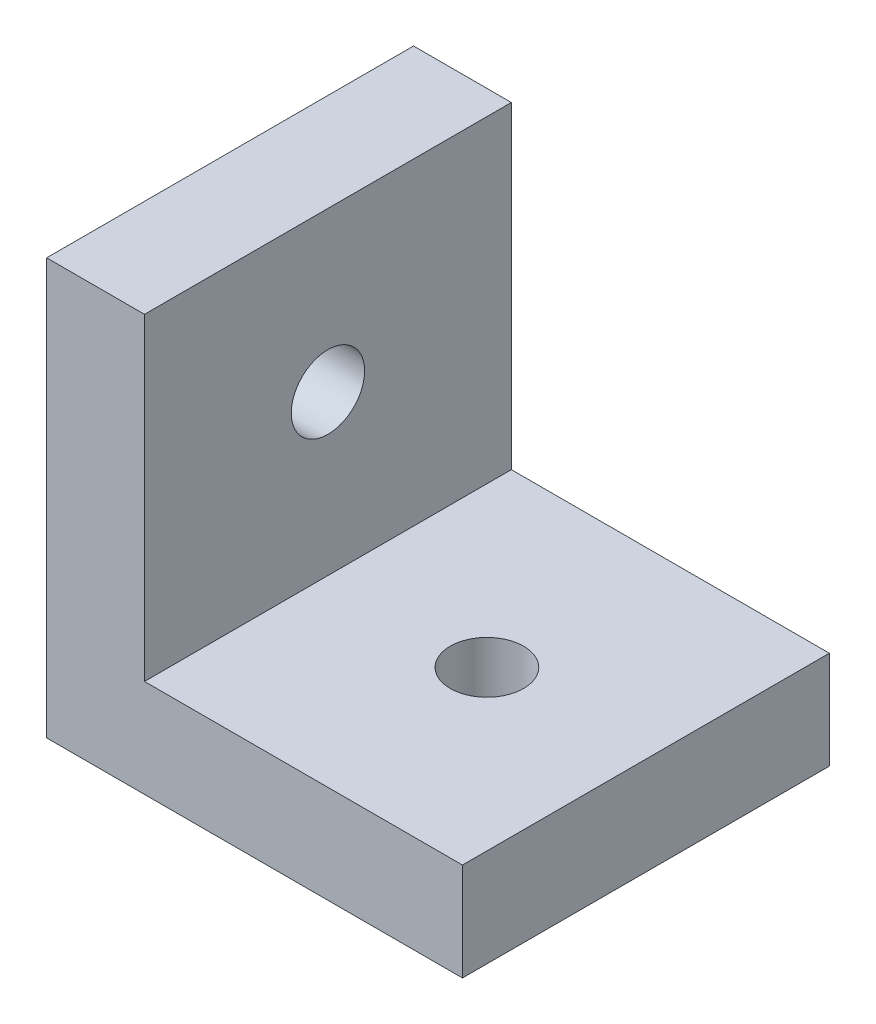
from build123d import *

# Parameters (mm, degrees)
BOSS_EXTRU_1_DEPTH      = 15
ESQUISSE2_R             = 1.5
ENL_V_MAT_EXTRU_1_DEPTH = 15
ESQUISSE3_R             = 1.5
ENL_V_MAT_EXTRU_2_DEPTH = 15


with BuildPart() as part:
    # Esquisse1 → Boss.-Extru.1 (new body)
    with BuildSketch(Plane.XY):
        Polygon((0, 0), (17, 0), (17, 4), (4, 4), (4, 17), (0, 17), align=None)
    extrude(amount=BOSS_EXTRU_1_DEPTH)

    # Esquisse2 → Enl_v. mat.-Extru.1 (cut)
    with BuildSketch(Plane(origin=(4, 0, 0), x_dir=(0, 0, -1), z_dir=(1, 0, 0))):
        with Locations((-7.5, 10.5)):
            Circle(ESQUISSE2_R)
    extrude(amount=-ENL_V_MAT_EXTRU_1_DEPTH, mode=Mode.SUBTRACT)

    # Esquisse3 → Enl_v. mat.-Extru.2 (cut)
    with BuildSketch(Plane(origin=(0, 4, 0), x_dir=(1, 0, 0), z_dir=(0, 1, 0))):
        with Locations(Location((10.5, -7.5, 0), (0, 0, 270))):
            Circle(ESQUISSE3_R)
    extrude(amount=-ENL_V_MAT_EXTRU_2_DEPTH, mode=Mode.SUBTRACT)


solid = part.part
